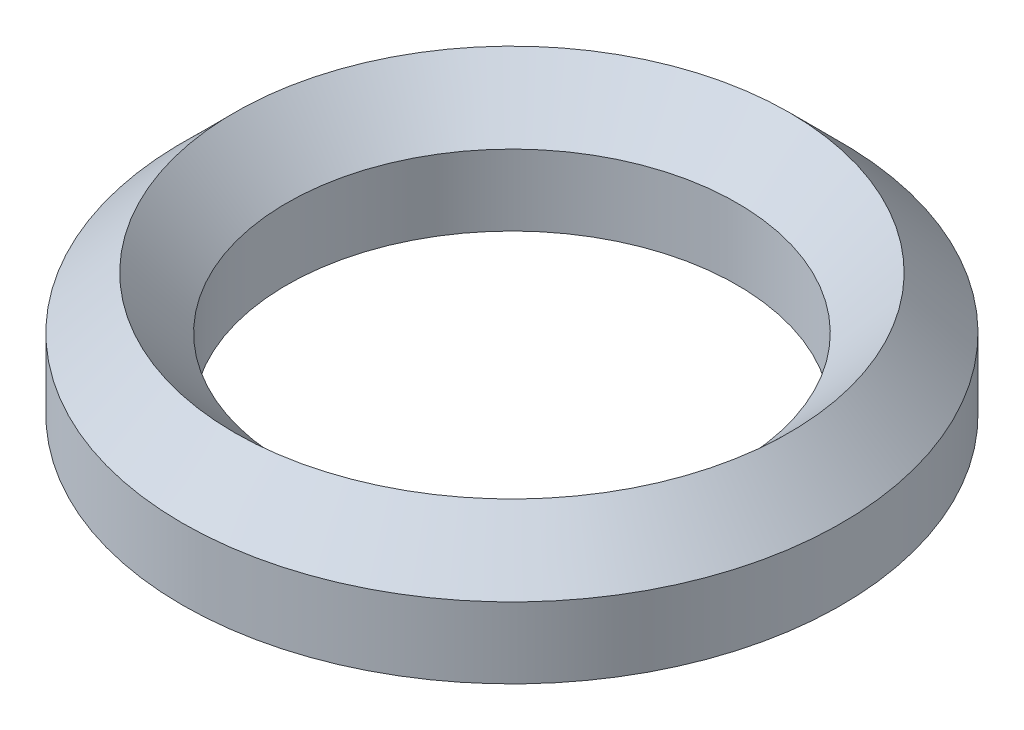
ISO-10303-21;
HEADER;
FILE_DESCRIPTION(('STEP AP214'),'2;1');
FILE_NAME('part.step','',(''),(''),'','','');
FILE_SCHEMA(('AUTOMOTIVE_DESIGN { 1 0 10303 214 1 1 1 1 }'));
ENDSEC;
DATA;
#1=APPLICATION_CONTEXT('core data for automotive mechanical design processes');
#2=APPLICATION_PROTOCOL_DEFINITION('international standard','automotive_design',2000,#1);
#3=PRODUCT_CONTEXT('',#1,'mechanical');
#4=PRODUCT('Part','Part','',(#3));
#5=PRODUCT_RELATED_PRODUCT_CATEGORY('part','',(#4));
#6=PRODUCT_DEFINITION_FORMATION('','',#4);
#7=PRODUCT_DEFINITION_CONTEXT('part definition',#1,'design');
#8=PRODUCT_DEFINITION('design','',#6,#7);
#9=PRODUCT_DEFINITION_SHAPE('','',#8);
#10=(LENGTH_UNIT() NAMED_UNIT(*) SI_UNIT(.MILLI.,.METRE.));
#11=(NAMED_UNIT(*) PLANE_ANGLE_UNIT() SI_UNIT($,.RADIAN.));
#12=(NAMED_UNIT(*) SI_UNIT($,.STERADIAN.) SOLID_ANGLE_UNIT());
#13=UNCERTAINTY_MEASURE_WITH_UNIT(LENGTH_MEASURE(1.E-05),#10,'distance_accuracy_value','');
#14=(GEOMETRIC_REPRESENTATION_CONTEXT(3) GLOBAL_UNCERTAINTY_ASSIGNED_CONTEXT((#13)) GLOBAL_UNIT_ASSIGNED_CONTEXT((#10,
#11,#12)) REPRESENTATION_CONTEXT('',''));
#15=CARTESIAN_POINT('',(0.,0.,0.));
#16=DIRECTION('',(0.,0.,1.));
#17=DIRECTION('',(1.,0.,0.));
#18=AXIS2_PLACEMENT_3D('',#15,#16,#17);
#19=CARTESIAN_POINT('',(0.,-3.5,0.));
#20=DIRECTION('',(0.,-1.,0.));
#21=DIRECTION('',(0.,0.,-1.));
#22=AXIS2_PLACEMENT_3D('',#19,#20,#21);
#23=CONICAL_SURFACE('',#22,13.675,0.785398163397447);
#24=CARTESIAN_POINT('',(0.,-6.07499999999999,0.));
#25=DIRECTION('',(0.,1.,0.));
#26=DIRECTION('',(0.,0.,1.));
#27=AXIS2_PLACEMENT_3D('',#24,#25,#26);
#28=CIRCLE('',#27,16.25);
#29=CARTESIAN_POINT('',(0.,-6.07499999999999,16.2499999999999));
#30=VERTEX_POINT('',#29);
#31=EDGE_CURVE('E10',#30,#30,#28,.T.);
#32=ORIENTED_EDGE('',*,*,#31,.F.);
#33=EDGE_LOOP('',(#32));
#34=FACE_BOUND('',#33,.T.);
#35=CARTESIAN_POINT('',(0.,-3.5,0.));
#36=DIRECTION('',(0.,1.,0.));
#37=DIRECTION('',(0.,0.,1.));
#38=AXIS2_PLACEMENT_3D('',#35,#36,#37);
#39=CIRCLE('',#38,13.675);
#40=CARTESIAN_POINT('',(0.,-3.5,13.675));
#41=VERTEX_POINT('',#40);
#42=EDGE_CURVE('E53',#41,#41,#39,.T.);
#43=ORIENTED_EDGE('',*,*,#42,.T.);
#44=EDGE_LOOP('',(#43));
#45=FACE_BOUND('',#44,.T.);
#46=ADVANCED_FACE('F31',(#34,#45),#23,.F.);
#47=CARTESIAN_POINT('',(0.,3.31908542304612,0.));
#48=DIRECTION('',(0.,1.,0.));
#49=DIRECTION('',(0.,0.,1.));
#50=AXIS2_PLACEMENT_3D('',#47,#48,#49);
#51=CYLINDRICAL_SURFACE('',#50,16.25);
#52=CARTESIAN_POINT('',(0.,-2.575,0.));
#53=DIRECTION('',(0.,1.,0.));
#54=DIRECTION('',(0.,0.,1.));
#55=AXIS2_PLACEMENT_3D('',#52,#53,#54);
#56=CIRCLE('',#55,16.25);
#57=CARTESIAN_POINT('',(0.,-2.575,16.25));
#58=VERTEX_POINT('',#57);
#59=EDGE_CURVE('E37',#58,#58,#56,.T.);
#60=ORIENTED_EDGE('',*,*,#59,.F.);
#61=EDGE_LOOP('',(#60));
#62=FACE_BOUND('',#61,.T.);
#63=ORIENTED_EDGE('',*,*,#31,.T.);
#64=EDGE_LOOP('',(#63));
#65=FACE_BOUND('',#64,.T.);
#66=ADVANCED_FACE('F78',(#62,#65),#51,.T.);
#67=CARTESIAN_POINT('',(0.,-2.575,0.));
#68=DIRECTION('',(0.,-1.,0.));
#69=DIRECTION('',(0.,0.,-1.));
#70=AXIS2_PLACEMENT_3D('',#67,#68,#69);
#71=CONICAL_SURFACE('',#70,16.25,0.785398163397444);
#72=CARTESIAN_POINT('',(0.,0.,0.));
#73=DIRECTION('',(0.,1.,0.));
#74=DIRECTION('',(0.,0.,1.));
#75=AXIS2_PLACEMENT_3D('',#72,#73,#74);
#76=CIRCLE('',#75,13.675);
#77=CARTESIAN_POINT('',(0.,0.,13.675));
#78=VERTEX_POINT('',#77);
#79=EDGE_CURVE('E41',#78,#78,#76,.T.);
#80=ORIENTED_EDGE('',*,*,#79,.F.);
#81=EDGE_LOOP('',(#80));
#82=FACE_BOUND('',#81,.T.);
#83=ORIENTED_EDGE('',*,*,#59,.T.);
#84=EDGE_LOOP('',(#83));
#85=FACE_BOUND('',#84,.T.);
#86=ADVANCED_FACE('F73',(#82,#85),#71,.T.);
#87=CARTESIAN_POINT('',(0.,0.,0.));
#88=DIRECTION('',(0.,1.,0.));
#89=DIRECTION('',(0.,0.,1.));
#90=AXIS2_PLACEMENT_3D('',#87,#88,#89);
#91=CONICAL_SURFACE('',#90,13.675,0.785398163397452);
#92=CARTESIAN_POINT('',(0.,-2.575,0.));
#93=DIRECTION('',(0.,1.,0.));
#94=DIRECTION('',(0.,0.,1.));
#95=AXIS2_PLACEMENT_3D('',#92,#93,#94);
#96=CIRCLE('',#95,11.1);
#97=CARTESIAN_POINT('',(0.,-2.575,11.1));
#98=VERTEX_POINT('',#97);
#99=EDGE_CURVE('E45',#98,#98,#96,.T.);
#100=ORIENTED_EDGE('',*,*,#99,.F.);
#101=EDGE_LOOP('',(#100));
#102=FACE_BOUND('',#101,.T.);
#103=ORIENTED_EDGE('',*,*,#79,.T.);
#104=EDGE_LOOP('',(#103));
#105=FACE_BOUND('',#104,.T.);
#106=ADVANCED_FACE('F67',(#102,#105),#91,.F.);
#107=CARTESIAN_POINT('',(0.,3.31908542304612,0.));
#108=DIRECTION('',(0.,1.,0.));
#109=DIRECTION('',(0.,0.,1.));
#110=AXIS2_PLACEMENT_3D('',#107,#108,#109);
#111=CYLINDRICAL_SURFACE('',#110,11.1);
#112=CARTESIAN_POINT('',(0.,-6.07499999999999,0.));
#113=DIRECTION('',(0.,1.,0.));
#114=DIRECTION('',(0.,0.,1.));
#115=AXIS2_PLACEMENT_3D('',#112,#113,#114);
#116=CIRCLE('',#115,11.1);
#117=CARTESIAN_POINT('',(0.,-6.07499999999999,11.1));
#118=VERTEX_POINT('',#117);
#119=EDGE_CURVE('E50',#118,#118,#116,.T.);
#120=ORIENTED_EDGE('',*,*,#119,.F.);
#121=EDGE_LOOP('',(#120));
#122=FACE_BOUND('',#121,.T.);
#123=ORIENTED_EDGE('',*,*,#99,.T.);
#124=EDGE_LOOP('',(#123));
#125=FACE_BOUND('',#124,.T.);
#126=ADVANCED_FACE('F61',(#122,#125),#111,.F.);
#127=CARTESIAN_POINT('',(0.,-6.07499999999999,0.));
#128=DIRECTION('',(0.,1.,0.));
#129=DIRECTION('',(0.,0.,1.));
#130=AXIS2_PLACEMENT_3D('',#127,#128,#129);
#131=CONICAL_SURFACE('',#130,11.1,0.785398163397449);
#132=ORIENTED_EDGE('',*,*,#42,.F.);
#133=EDGE_LOOP('',(#132));
#134=FACE_BOUND('',#133,.T.);
#135=ORIENTED_EDGE('',*,*,#119,.T.);
#136=EDGE_LOOP('',(#135));
#137=FACE_BOUND('',#136,.T.);
#138=ADVANCED_FACE('F58',(#134,#137),#131,.T.);
#139=CLOSED_SHELL('',(#46,#66,#86,#106,#126,#138));
#140=MANIFOLD_SOLID_BREP('B2',#139);
#141=ADVANCED_BREP_SHAPE_REPRESENTATION('',(#18,#140),#14);
#142=SHAPE_DEFINITION_REPRESENTATION(#9,#141);
ENDSEC;
END-ISO-10303-21;
